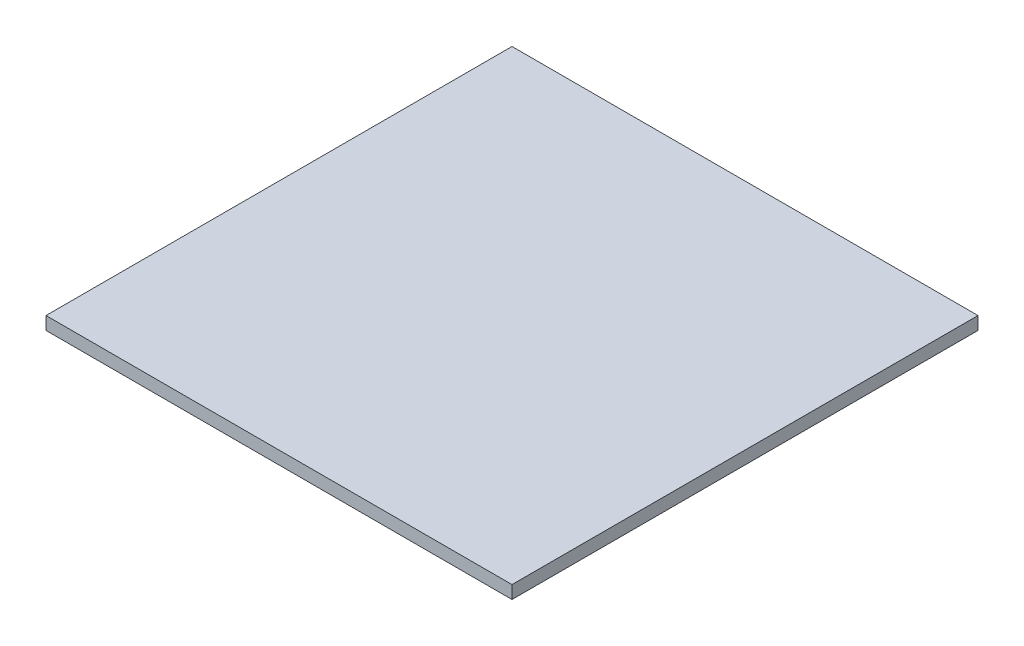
from build123d import *

# Parameters (mm, degrees)
SKETCH1_W           = 457.2
SKETCH1_H           = 457.2
BOSS_EXTRUDE1_DEPTH = 12.7


with BuildPart() as part:
    # Sketch1 → Boss-Extrude1 (new body)
    with BuildSketch(Plane(origin=(0, 0, 0), x_dir=(1, 0, 0), z_dir=(0, 1, 0))):
        with Locations((228.6, 228.6)):
            Rectangle(SKETCH1_W, SKETCH1_H)
    extrude(amount=BOSS_EXTRUDE1_DEPTH)


solid = part.part
